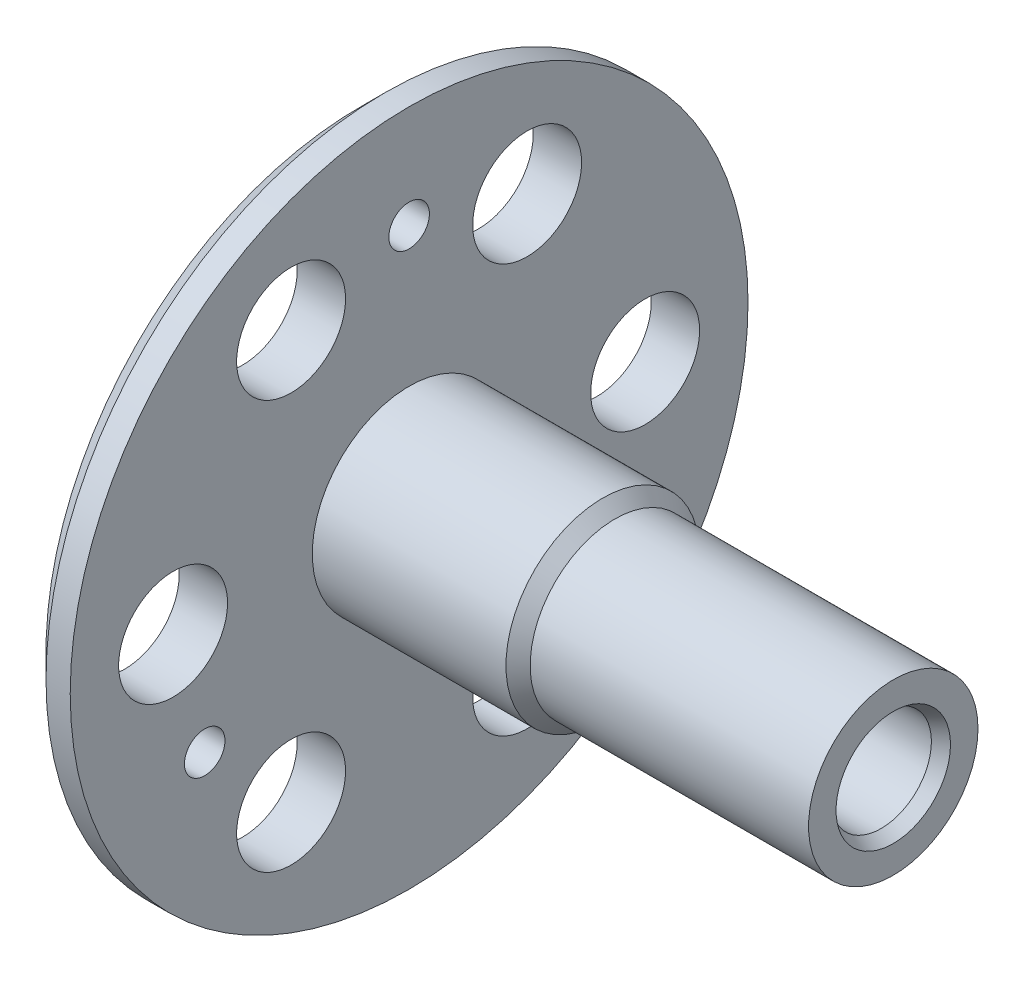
ISO-10303-21;
HEADER;
FILE_DESCRIPTION(('STEP AP214'),'2;1');
FILE_NAME('part.step','',(''),(''),'','','');
FILE_SCHEMA(('AUTOMOTIVE_DESIGN { 1 0 10303 214 1 1 1 1 }'));
ENDSEC;
DATA;
#1=APPLICATION_CONTEXT('core data for automotive mechanical design processes');
#2=APPLICATION_PROTOCOL_DEFINITION('international standard','automotive_design',2000,#1);
#3=PRODUCT_CONTEXT('',#1,'mechanical');
#4=PRODUCT('Part','Part','',(#3));
#5=PRODUCT_RELATED_PRODUCT_CATEGORY('part','',(#4));
#6=PRODUCT_DEFINITION_FORMATION('','',#4);
#7=PRODUCT_DEFINITION_CONTEXT('part definition',#1,'design');
#8=PRODUCT_DEFINITION('design','',#6,#7);
#9=PRODUCT_DEFINITION_SHAPE('','',#8);
#10=(LENGTH_UNIT() NAMED_UNIT(*) SI_UNIT(.MILLI.,.METRE.));
#11=(NAMED_UNIT(*) PLANE_ANGLE_UNIT() SI_UNIT($,.RADIAN.));
#12=(NAMED_UNIT(*) SI_UNIT($,.STERADIAN.) SOLID_ANGLE_UNIT());
#13=UNCERTAINTY_MEASURE_WITH_UNIT(LENGTH_MEASURE(1.E-05),#10,'distance_accuracy_value','');
#14=(GEOMETRIC_REPRESENTATION_CONTEXT(3) GLOBAL_UNCERTAINTY_ASSIGNED_CONTEXT((#13)) GLOBAL_UNIT_ASSIGNED_CONTEXT((#10,
#11,#12)) REPRESENTATION_CONTEXT('',''));
#15=CARTESIAN_POINT('',(0.,0.,0.));
#16=DIRECTION('',(0.,0.,1.));
#17=DIRECTION('',(1.,0.,0.));
#18=AXIS2_PLACEMENT_3D('',#15,#16,#17);
#19=CARTESIAN_POINT('',(13.,0.,0.));
#20=DIRECTION('',(-1.,0.,0.));
#21=DIRECTION('',(0.,0.,1.));
#22=AXIS2_PLACEMENT_3D('',#19,#20,#21);
#23=PLANE('',#22);
#24=CARTESIAN_POINT('',(12.9999999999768,0.,0.));
#25=DIRECTION('',(1.,0.,0.));
#26=DIRECTION('',(0.,0.,-1.));
#27=AXIS2_PLACEMENT_3D('',#24,#25,#26);
#28=CIRCLE('',#27,2.);
#29=CARTESIAN_POINT('',(12.9999999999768,0.,-2.));
#30=VERTEX_POINT('',#29);
#31=EDGE_CURVE('E107',#30,#30,#28,.F.);
#32=ORIENTED_EDGE('',*,*,#31,.T.);
#33=EDGE_LOOP('',(#32));
#34=FACE_BOUND('',#33,.T.);
#35=CARTESIAN_POINT('',(13.,0.,0.));
#36=DIRECTION('',(-1.,0.,0.));
#37=DIRECTION('',(0.,0.,1.));
#38=AXIS2_PLACEMENT_3D('',#35,#36,#37);
#39=CIRCLE('',#38,2.075);
#40=CARTESIAN_POINT('',(13.,0.,2.075));
#41=VERTEX_POINT('',#40);
#42=EDGE_CURVE('E18',#41,#41,#39,.F.);
#43=ORIENTED_EDGE('',*,*,#42,.T.);
#44=EDGE_LOOP('',(#43));
#45=FACE_BOUND('',#44,.T.);
#46=ADVANCED_FACE('F15',(#34,#45),#23,.F.);
#47=CARTESIAN_POINT('',(22.,0.,0.));
#48=DIRECTION('',(-1.,0.,0.));
#49=DIRECTION('',(0.,0.,1.));
#50=AXIS2_PLACEMENT_3D('',#47,#48,#49);
#51=CYLINDRICAL_SURFACE('',#50,2.075);
#52=ORIENTED_EDGE('',*,*,#42,.F.);
#53=EDGE_LOOP('',(#52));
#54=FACE_BOUND('',#53,.T.);
#55=CARTESIAN_POINT('',(21.4999999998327,0.,0.));
#56=DIRECTION('',(1.,0.,0.));
#57=DIRECTION('',(0.,0.,1.));
#58=AXIS2_PLACEMENT_3D('',#55,#56,#57);
#59=CIRCLE('',#58,2.0750000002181);
#60=CARTESIAN_POINT('',(21.4999999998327,0.,2.0750000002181));
#61=VERTEX_POINT('',#60);
#62=EDGE_CURVE('E106',#61,#61,#59,.T.);
#63=ORIENTED_EDGE('',*,*,#62,.T.);
#64=EDGE_LOOP('',(#63));
#65=FACE_BOUND('',#64,.T.);
#66=ADVANCED_FACE('F116',(#54,#65),#51,.F.);
#67=CARTESIAN_POINT('',(494999.999992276,0.,0.));
#68=DIRECTION('',(1.,0.,0.));
#69=DIRECTION('',(0.,0.,-1.));
#70=AXIS2_PLACEMENT_3D('',#67,#68,#69);
#71=CYLINDRICAL_SURFACE('',#70,2.);
#72=CARTESIAN_POINT('',(2.9999999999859,0.,0.));
#73=DIRECTION('',(1.,0.,0.));
#74=DIRECTION('',(0.,0.,-1.));
#75=AXIS2_PLACEMENT_3D('',#72,#73,#74);
#76=CIRCLE('',#75,2.);
#77=CARTESIAN_POINT('',(2.9999999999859,0.,-2.));
#78=VERTEX_POINT('',#77);
#79=EDGE_CURVE('E104',#78,#78,#76,.F.);
#80=ORIENTED_EDGE('',*,*,#79,.T.);
#81=EDGE_LOOP('',(#80));
#82=FACE_BOUND('',#81,.T.);
#83=ORIENTED_EDGE('',*,*,#31,.F.);
#84=EDGE_LOOP('',(#83));
#85=FACE_BOUND('',#84,.T.);
#86=ADVANCED_FACE('F119',(#82,#85),#71,.F.);
#87=CARTESIAN_POINT('',(22.0000000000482,0.,0.));
#88=DIRECTION('',(1.,0.,0.));
#89=DIRECTION('',(0.,0.,-1.));
#90=AXIS2_PLACEMENT_3D('',#87,#88,#89);
#91=CONICAL_SURFACE('',#90,2.36367513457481,0.52359877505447);
#92=CARTESIAN_POINT('',(22.0000000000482,0.,0.));
#93=DIRECTION('',(1.,0.,0.));
#94=DIRECTION('',(0.,0.,-1.));
#95=AXIS2_PLACEMENT_3D('',#92,#93,#94);
#96=CIRCLE('',#95,2.36367513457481);
#97=CARTESIAN_POINT('',(22.0000000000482,0.,-2.36367513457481));
#98=VERTEX_POINT('',#97);
#99=EDGE_CURVE('E101',#98,#98,#96,.F.);
#100=ORIENTED_EDGE('',*,*,#99,.F.);
#101=EDGE_LOOP('',(#100));
#102=FACE_BOUND('',#101,.T.);
#103=ORIENTED_EDGE('',*,*,#62,.F.);
#104=EDGE_LOOP('',(#103));
#105=FACE_BOUND('',#104,.T.);
#106=ADVANCED_FACE('F122',(#102,#105),#91,.F.);
#107=CARTESIAN_POINT('',(3.,0.,0.));
#108=DIRECTION('',(1.,0.,0.));
#109=DIRECTION('',(0.,0.,-1.));
#110=AXIS2_PLACEMENT_3D('',#107,#108,#109);
#111=PLANE('',#110);
#112=CARTESIAN_POINT('',(3.,0.,0.));
#113=DIRECTION('',(1.,0.,0.));
#114=DIRECTION('',(0.,0.,-1.));
#115=AXIS2_PLACEMENT_3D('',#112,#113,#114);
#116=CIRCLE('',#115,3.);
#117=CARTESIAN_POINT('',(3.,0.,-3.));
#118=VERTEX_POINT('',#117);
#119=EDGE_CURVE('E98',#118,#118,#116,.F.);
#120=ORIENTED_EDGE('',*,*,#119,.T.);
#121=EDGE_LOOP('',(#120));
#122=FACE_BOUND('',#121,.T.);
#123=ORIENTED_EDGE('',*,*,#79,.F.);
#124=EDGE_LOOP('',(#123));
#125=FACE_BOUND('',#124,.T.);
#126=ADVANCED_FACE('F124',(#122,#125),#111,.F.);
#127=CARTESIAN_POINT('',(22.,0.,0.));
#128=DIRECTION('',(1.,0.,0.));
#129=DIRECTION('',(0.,0.,-1.));
#130=AXIS2_PLACEMENT_3D('',#127,#128,#129);
#131=PLANE('',#130);
#132=CARTESIAN_POINT('',(22.,0.,0.));
#133=DIRECTION('',(1.,0.,0.));
#134=DIRECTION('',(0.,0.,-1.));
#135=AXIS2_PLACEMENT_3D('',#132,#133,#134);
#136=CIRCLE('',#135,3.5);
#137=CARTESIAN_POINT('',(22.,0.,-3.5));
#138=VERTEX_POINT('',#137);
#139=EDGE_CURVE('E95',#138,#138,#136,.F.);
#140=ORIENTED_EDGE('',*,*,#139,.F.);
#141=EDGE_LOOP('',(#140));
#142=FACE_BOUND('',#141,.T.);
#143=ORIENTED_EDGE('',*,*,#99,.T.);
#144=EDGE_LOOP('',(#143));
#145=FACE_BOUND('',#144,.T.);
#146=ADVANCED_FACE('F132',(#142,#145),#131,.T.);
#147=CARTESIAN_POINT('',(0.,0.,0.));
#148=DIRECTION('',(1.,0.,0.));
#149=DIRECTION('',(0.,0.,-1.));
#150=AXIS2_PLACEMENT_3D('',#147,#148,#149);
#151=CYLINDRICAL_SURFACE('',#150,3.);
#152=CARTESIAN_POINT('',(0.,0.,0.));
#153=DIRECTION('',(1.,0.,0.));
#154=DIRECTION('',(0.,0.,-1.));
#155=AXIS2_PLACEMENT_3D('',#152,#153,#154);
#156=CIRCLE('',#155,3.);
#157=CARTESIAN_POINT('',(0.,0.,-3.));
#158=VERTEX_POINT('',#157);
#159=EDGE_CURVE('E92',#158,#158,#156,.T.);
#160=ORIENTED_EDGE('',*,*,#159,.F.);
#161=EDGE_LOOP('',(#160));
#162=FACE_BOUND('',#161,.T.);
#163=ORIENTED_EDGE('',*,*,#119,.F.);
#164=EDGE_LOOP('',(#163));
#165=FACE_BOUND('',#164,.T.);
#166=ADVANCED_FACE('F204',(#162,#165),#151,.F.);
#167=CARTESIAN_POINT('',(10.5,0.,0.));
#168=DIRECTION('',(1.,0.,0.));
#169=DIRECTION('',(0.,0.,-1.));
#170=AXIS2_PLACEMENT_3D('',#167,#168,#169);
#171=CYLINDRICAL_SURFACE('',#170,3.5);
#172=CARTESIAN_POINT('',(10.4999999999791,0.,0.));
#173=DIRECTION('',(-1.,0.,0.));
#174=DIRECTION('',(0.,0.,-1.));
#175=AXIS2_PLACEMENT_3D('',#172,#173,#174);
#176=CIRCLE('',#175,3.49999999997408);
#177=CARTESIAN_POINT('',(10.4999999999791,0.,-3.49999999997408));
#178=VERTEX_POINT('',#177);
#179=EDGE_CURVE('E91',#178,#178,#176,.T.);
#180=ORIENTED_EDGE('',*,*,#179,.F.);
#181=EDGE_LOOP('',(#180));
#182=FACE_BOUND('',#181,.T.);
#183=ORIENTED_EDGE('',*,*,#139,.T.);
#184=EDGE_LOOP('',(#183));
#185=FACE_BOUND('',#184,.T.);
#186=ADVANCED_FACE('F200',(#182,#185),#171,.T.);
#187=CARTESIAN_POINT('',(0.,0.,0.));
#188=DIRECTION('',(-1.,0.,0.));
#189=DIRECTION('',(0.,0.,1.));
#190=AXIS2_PLACEMENT_3D('',#187,#188,#189);
#191=PLANE('',#190);
#192=ORIENTED_EDGE('',*,*,#159,.T.);
#193=EDGE_LOOP('',(#192));
#194=FACE_BOUND('',#193,.T.);
#195=CARTESIAN_POINT('',(0.,-8.44374768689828,-4.875));
#196=DIRECTION('',(1.,0.,0.));
#197=DIRECTION('',(0.,0.,-1.));
#198=AXIS2_PLACEMENT_3D('',#195,#196,#197);
#199=CIRCLE('',#198,2.25);
#200=CARTESIAN_POINT('',(0.,-8.44374768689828,-7.125));
#201=VERTEX_POINT('',#200);
#202=EDGE_CURVE('E60',#201,#201,#199,.T.);
#203=ORIENTED_EDGE('',*,*,#202,.T.);
#204=EDGE_LOOP('',(#203));
#205=FACE_BOUND('',#204,.T.);
#206=CARTESIAN_POINT('',(0.,-4.875,-8.44374768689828));
#207=DIRECTION('',(1.,0.,0.));
#208=DIRECTION('',(0.,0.,-1.));
#209=AXIS2_PLACEMENT_3D('',#206,#207,#208);
#210=CIRCLE('',#209,0.8376);
#211=CARTESIAN_POINT('',(0.,-4.875,-9.28134768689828));
#212=VERTEX_POINT('',#211);
#213=EDGE_CURVE('E64',#212,#212,#210,.T.);
#214=ORIENTED_EDGE('',*,*,#213,.T.);
#215=EDGE_LOOP('',(#214));
#216=FACE_BOUND('',#215,.T.);
#217=CARTESIAN_POINT('',(0.,0.,-9.75));
#218=DIRECTION('',(1.,0.,0.));
#219=DIRECTION('',(0.,0.,-1.));
#220=AXIS2_PLACEMENT_3D('',#217,#218,#219);
#221=CIRCLE('',#220,2.25);
#222=CARTESIAN_POINT('',(0.,0.,-12.));
#223=VERTEX_POINT('',#222);
#224=EDGE_CURVE('E67',#223,#223,#221,.T.);
#225=ORIENTED_EDGE('',*,*,#224,.T.);
#226=EDGE_LOOP('',(#225));
#227=FACE_BOUND('',#226,.T.);
#228=CARTESIAN_POINT('',(0.,8.44374768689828,-4.87500000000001));
#229=DIRECTION('',(1.,0.,0.));
#230=DIRECTION('',(0.,0.,-1.));
#231=AXIS2_PLACEMENT_3D('',#228,#229,#230);
#232=CIRCLE('',#231,2.25);
#233=CARTESIAN_POINT('',(0.,8.44374768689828,-7.12500000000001));
#234=VERTEX_POINT('',#233);
#235=EDGE_CURVE('E70',#234,#234,#232,.T.);
#236=ORIENTED_EDGE('',*,*,#235,.T.);
#237=EDGE_LOOP('',(#236));
#238=FACE_BOUND('',#237,.T.);
#239=CARTESIAN_POINT('',(0.,8.44374768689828,4.87499999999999));
#240=DIRECTION('',(1.,0.,0.));
#241=DIRECTION('',(0.,0.,-1.));
#242=AXIS2_PLACEMENT_3D('',#239,#240,#241);
#243=CIRCLE('',#242,2.25);
#244=CARTESIAN_POINT('',(0.,8.44374768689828,2.62499999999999));
#245=VERTEX_POINT('',#244);
#246=EDGE_CURVE('E73',#245,#245,#243,.T.);
#247=ORIENTED_EDGE('',*,*,#246,.T.);
#248=EDGE_LOOP('',(#247));
#249=FACE_BOUND('',#248,.T.);
#250=CARTESIAN_POINT('',(0.,0.,9.75));
#251=DIRECTION('',(1.,0.,0.));
#252=DIRECTION('',(0.,0.,-1.));
#253=AXIS2_PLACEMENT_3D('',#250,#251,#252);
#254=CIRCLE('',#253,2.25);
#255=CARTESIAN_POINT('',(0.,0.,7.5));
#256=VERTEX_POINT('',#255);
#257=EDGE_CURVE('E76',#256,#256,#254,.T.);
#258=ORIENTED_EDGE('',*,*,#257,.T.);
#259=EDGE_LOOP('',(#258));
#260=FACE_BOUND('',#259,.T.);
#261=CARTESIAN_POINT('',(0.,-8.44374768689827,4.87500000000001));
#262=DIRECTION('',(1.,0.,0.));
#263=DIRECTION('',(0.,0.,-1.));
#264=AXIS2_PLACEMENT_3D('',#261,#262,#263);
#265=CIRCLE('',#264,2.25);
#266=CARTESIAN_POINT('',(0.,-8.44374768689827,2.62500000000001));
#267=VERTEX_POINT('',#266);
#268=EDGE_CURVE('E79',#267,#267,#265,.T.);
#269=ORIENTED_EDGE('',*,*,#268,.T.);
#270=EDGE_LOOP('',(#269));
#271=FACE_BOUND('',#270,.T.);
#272=CARTESIAN_POINT('',(0.,9.75,0.));
#273=DIRECTION('',(1.,0.,0.));
#274=DIRECTION('',(0.,0.,-1.));
#275=AXIS2_PLACEMENT_3D('',#272,#273,#274);
#276=CIRCLE('',#275,0.8376);
#277=CARTESIAN_POINT('',(0.,9.75,-0.837599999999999));
#278=VERTEX_POINT('',#277);
#279=EDGE_CURVE('E82',#278,#278,#276,.T.);
#280=ORIENTED_EDGE('',*,*,#279,.T.);
#281=EDGE_LOOP('',(#280));
#282=FACE_BOUND('',#281,.T.);
#283=CARTESIAN_POINT('',(0.,-4.875,8.44374768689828));
#284=DIRECTION('',(1.,0.,0.));
#285=DIRECTION('',(0.,0.,-1.));
#286=AXIS2_PLACEMENT_3D('',#283,#284,#285);
#287=CIRCLE('',#286,0.8376);
#288=CARTESIAN_POINT('',(0.,-4.875,7.60614768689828));
#289=VERTEX_POINT('',#288);
#290=EDGE_CURVE('E85',#289,#289,#287,.T.);
#291=ORIENTED_EDGE('',*,*,#290,.T.);
#292=EDGE_LOOP('',(#291));
#293=FACE_BOUND('',#292,.T.);
#294=CARTESIAN_POINT('',(-8.97447697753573E-10,0.,0.));
#295=DIRECTION('',(1.,0.,0.));
#296=DIRECTION('',(0.,0.,-1.));
#297=AXIS2_PLACEMENT_3D('',#294,#295,#296);
#298=CIRCLE('',#297,13.0000000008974);
#299=CARTESIAN_POINT('',(-8.97447697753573E-10,0.,-13.0000000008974));
#300=VERTEX_POINT('',#299);
#301=EDGE_CURVE('E88',#300,#300,#298,.T.);
#302=ORIENTED_EDGE('',*,*,#301,.F.);
#303=EDGE_LOOP('',(#302));
#304=FACE_BOUND('',#303,.T.);
#305=ADVANCED_FACE('F196',(#194,#205,#216,#227,#238,#249,#260,#271,#282,#293,#304),#191,.T.);
#306=CARTESIAN_POINT('',(9.999999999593,0.,0.));
#307=DIRECTION('',(-1.,0.,0.));
#308=DIRECTION('',(0.,0.,1.));
#309=AXIS2_PLACEMENT_3D('',#306,#307,#308);
#310=CONICAL_SURFACE('',#309,3.99999999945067,0.785398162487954);
#311=ORIENTED_EDGE('',*,*,#179,.T.);
#312=EDGE_LOOP('',(#311));
#313=FACE_BOUND('',#312,.T.);
#314=CARTESIAN_POINT('',(10.,0.,0.));
#315=DIRECTION('',(1.,0.,0.));
#316=DIRECTION('',(0.,0.,-1.));
#317=AXIS2_PLACEMENT_3D('',#314,#315,#316);
#318=CIRCLE('',#317,4.);
#319=CARTESIAN_POINT('',(10.,0.,-4.));
#320=VERTEX_POINT('',#319);
#321=EDGE_CURVE('E63',#320,#320,#318,.F.);
#322=ORIENTED_EDGE('',*,*,#321,.F.);
#323=EDGE_LOOP('',(#322));
#324=FACE_BOUND('',#323,.T.);
#325=ADVANCED_FACE('F192',(#313,#324),#310,.T.);
#326=CARTESIAN_POINT('',(1.,0.,0.));
#327=DIRECTION('',(1.,0.,0.));
#328=DIRECTION('',(0.,0.,-1.));
#329=AXIS2_PLACEMENT_3D('',#326,#327,#328);
#330=CONICAL_SURFACE('',#329,14.,0.7853981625);
#331=CARTESIAN_POINT('',(1.,0.,0.));
#332=DIRECTION('',(1.,0.,0.));
#333=DIRECTION('',(0.,0.,-1.));
#334=AXIS2_PLACEMENT_3D('',#331,#332,#333);
#335=CIRCLE('',#334,14.);
#336=CARTESIAN_POINT('',(1.,0.,-14.));
#337=VERTEX_POINT('',#336);
#338=EDGE_CURVE('E59',#337,#337,#335,.T.);
#339=ORIENTED_EDGE('',*,*,#338,.F.);
#340=EDGE_LOOP('',(#339));
#341=FACE_BOUND('',#340,.T.);
#342=ORIENTED_EDGE('',*,*,#301,.T.);
#343=EDGE_LOOP('',(#342));
#344=FACE_BOUND('',#343,.T.);
#345=ADVANCED_FACE('F188',(#341,#344),#330,.T.);
#346=CARTESIAN_POINT('',(0.,-4.875,8.44374768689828));
#347=DIRECTION('',(1.,0.,0.));
#348=DIRECTION('',(0.,0.,-1.));
#349=AXIS2_PLACEMENT_3D('',#346,#347,#348);
#350=CYLINDRICAL_SURFACE('',#349,0.8376);
#351=ORIENTED_EDGE('',*,*,#290,.F.);
#352=EDGE_LOOP('',(#351));
#353=FACE_BOUND('',#352,.T.);
#354=CARTESIAN_POINT('',(2.,-4.875,8.44374768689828));
#355=DIRECTION('',(1.,0.,0.));
#356=DIRECTION('',(0.,0.,-1.));
#357=AXIS2_PLACEMENT_3D('',#354,#355,#356);
#358=CIRCLE('',#357,0.8376);
#359=CARTESIAN_POINT('',(2.,-4.875,7.60614768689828));
#360=VERTEX_POINT('',#359);
#361=EDGE_CURVE('E56',#360,#360,#358,.F.);
#362=ORIENTED_EDGE('',*,*,#361,.F.);
#363=EDGE_LOOP('',(#362));
#364=FACE_BOUND('',#363,.T.);
#365=ADVANCED_FACE('F184',(#353,#364),#350,.F.);
#366=CARTESIAN_POINT('',(0.,9.75,0.));
#367=DIRECTION('',(1.,0.,0.));
#368=DIRECTION('',(0.,0.,-1.));
#369=AXIS2_PLACEMENT_3D('',#366,#367,#368);
#370=CYLINDRICAL_SURFACE('',#369,0.8376);
#371=ORIENTED_EDGE('',*,*,#279,.F.);
#372=EDGE_LOOP('',(#371));
#373=FACE_BOUND('',#372,.T.);
#374=CARTESIAN_POINT('',(2.,9.75,0.));
#375=DIRECTION('',(1.,0.,0.));
#376=DIRECTION('',(0.,0.,-1.));
#377=AXIS2_PLACEMENT_3D('',#374,#375,#376);
#378=CIRCLE('',#377,0.8376);
#379=CARTESIAN_POINT('',(2.,9.75,-0.837599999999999));
#380=VERTEX_POINT('',#379);
#381=EDGE_CURVE('E53',#380,#380,#378,.F.);
#382=ORIENTED_EDGE('',*,*,#381,.F.);
#383=EDGE_LOOP('',(#382));
#384=FACE_BOUND('',#383,.T.);
#385=ADVANCED_FACE('F180',(#373,#384),#370,.F.);
#386=CARTESIAN_POINT('',(0.,-8.44374768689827,4.87500000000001));
#387=DIRECTION('',(1.,0.,0.));
#388=DIRECTION('',(0.,0.,-1.));
#389=AXIS2_PLACEMENT_3D('',#386,#387,#388);
#390=CYLINDRICAL_SURFACE('',#389,2.25);
#391=ORIENTED_EDGE('',*,*,#268,.F.);
#392=EDGE_LOOP('',(#391));
#393=FACE_BOUND('',#392,.T.);
#394=CARTESIAN_POINT('',(2.,-8.44374768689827,4.87500000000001));
#395=DIRECTION('',(1.,0.,0.));
#396=DIRECTION('',(0.,0.,-1.));
#397=AXIS2_PLACEMENT_3D('',#394,#395,#396);
#398=CIRCLE('',#397,2.25);
#399=CARTESIAN_POINT('',(2.,-8.44374768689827,2.62500000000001));
#400=VERTEX_POINT('',#399);
#401=EDGE_CURVE('E50',#400,#400,#398,.F.);
#402=ORIENTED_EDGE('',*,*,#401,.F.);
#403=EDGE_LOOP('',(#402));
#404=FACE_BOUND('',#403,.T.);
#405=ADVANCED_FACE('F176',(#393,#404),#390,.F.);
#406=CARTESIAN_POINT('',(0.,0.,9.75));
#407=DIRECTION('',(1.,0.,0.));
#408=DIRECTION('',(0.,0.,-1.));
#409=AXIS2_PLACEMENT_3D('',#406,#407,#408);
#410=CYLINDRICAL_SURFACE('',#409,2.25);
#411=ORIENTED_EDGE('',*,*,#257,.F.);
#412=EDGE_LOOP('',(#411));
#413=FACE_BOUND('',#412,.T.);
#414=CARTESIAN_POINT('',(2.,0.,9.75));
#415=DIRECTION('',(1.,0.,0.));
#416=DIRECTION('',(0.,0.,-1.));
#417=AXIS2_PLACEMENT_3D('',#414,#415,#416);
#418=CIRCLE('',#417,2.25);
#419=CARTESIAN_POINT('',(2.,0.,7.5));
#420=VERTEX_POINT('',#419);
#421=EDGE_CURVE('E47',#420,#420,#418,.F.);
#422=ORIENTED_EDGE('',*,*,#421,.F.);
#423=EDGE_LOOP('',(#422));
#424=FACE_BOUND('',#423,.T.);
#425=ADVANCED_FACE('F172',(#413,#424),#410,.F.);
#426=CARTESIAN_POINT('',(0.,8.44374768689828,4.87499999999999));
#427=DIRECTION('',(1.,0.,0.));
#428=DIRECTION('',(0.,0.,-1.));
#429=AXIS2_PLACEMENT_3D('',#426,#427,#428);
#430=CYLINDRICAL_SURFACE('',#429,2.25);
#431=ORIENTED_EDGE('',*,*,#246,.F.);
#432=EDGE_LOOP('',(#431));
#433=FACE_BOUND('',#432,.T.);
#434=CARTESIAN_POINT('',(2.,8.44374768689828,4.87499999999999));
#435=DIRECTION('',(1.,0.,0.));
#436=DIRECTION('',(0.,0.,-1.));
#437=AXIS2_PLACEMENT_3D('',#434,#435,#436);
#438=CIRCLE('',#437,2.25);
#439=CARTESIAN_POINT('',(2.,8.44374768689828,2.62499999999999));
#440=VERTEX_POINT('',#439);
#441=EDGE_CURVE('E44',#440,#440,#438,.F.);
#442=ORIENTED_EDGE('',*,*,#441,.F.);
#443=EDGE_LOOP('',(#442));
#444=FACE_BOUND('',#443,.T.);
#445=ADVANCED_FACE('F168',(#433,#444),#430,.F.);
#446=CARTESIAN_POINT('',(0.,8.44374768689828,-4.87500000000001));
#447=DIRECTION('',(1.,0.,0.));
#448=DIRECTION('',(0.,0.,-1.));
#449=AXIS2_PLACEMENT_3D('',#446,#447,#448);
#450=CYLINDRICAL_SURFACE('',#449,2.25);
#451=ORIENTED_EDGE('',*,*,#235,.F.);
#452=EDGE_LOOP('',(#451));
#453=FACE_BOUND('',#452,.T.);
#454=CARTESIAN_POINT('',(2.,8.44374768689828,-4.87500000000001));
#455=DIRECTION('',(1.,0.,0.));
#456=DIRECTION('',(0.,0.,-1.));
#457=AXIS2_PLACEMENT_3D('',#454,#455,#456);
#458=CIRCLE('',#457,2.25);
#459=CARTESIAN_POINT('',(2.,8.44374768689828,-7.12500000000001));
#460=VERTEX_POINT('',#459);
#461=EDGE_CURVE('E41',#460,#460,#458,.F.);
#462=ORIENTED_EDGE('',*,*,#461,.F.);
#463=EDGE_LOOP('',(#462));
#464=FACE_BOUND('',#463,.T.);
#465=ADVANCED_FACE('F164',(#453,#464),#450,.F.);
#466=CARTESIAN_POINT('',(0.,0.,-9.75));
#467=DIRECTION('',(1.,0.,0.));
#468=DIRECTION('',(0.,0.,-1.));
#469=AXIS2_PLACEMENT_3D('',#466,#467,#468);
#470=CYLINDRICAL_SURFACE('',#469,2.25);
#471=ORIENTED_EDGE('',*,*,#224,.F.);
#472=EDGE_LOOP('',(#471));
#473=FACE_BOUND('',#472,.T.);
#474=CARTESIAN_POINT('',(2.,0.,-9.75));
#475=DIRECTION('',(1.,0.,0.));
#476=DIRECTION('',(0.,0.,-1.));
#477=AXIS2_PLACEMENT_3D('',#474,#475,#476);
#478=CIRCLE('',#477,2.25);
#479=CARTESIAN_POINT('',(2.,0.,-12.));
#480=VERTEX_POINT('',#479);
#481=EDGE_CURVE('E38',#480,#480,#478,.F.);
#482=ORIENTED_EDGE('',*,*,#481,.F.);
#483=EDGE_LOOP('',(#482));
#484=FACE_BOUND('',#483,.T.);
#485=ADVANCED_FACE('F160',(#473,#484),#470,.F.);
#486=CARTESIAN_POINT('',(0.,-4.875,-8.44374768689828));
#487=DIRECTION('',(1.,0.,0.));
#488=DIRECTION('',(0.,0.,-1.));
#489=AXIS2_PLACEMENT_3D('',#486,#487,#488);
#490=CYLINDRICAL_SURFACE('',#489,0.8376);
#491=ORIENTED_EDGE('',*,*,#213,.F.);
#492=EDGE_LOOP('',(#491));
#493=FACE_BOUND('',#492,.T.);
#494=CARTESIAN_POINT('',(2.,-4.875,-8.44374768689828));
#495=DIRECTION('',(1.,0.,0.));
#496=DIRECTION('',(0.,0.,-1.));
#497=AXIS2_PLACEMENT_3D('',#494,#495,#496);
#498=CIRCLE('',#497,0.8376);
#499=CARTESIAN_POINT('',(2.,-4.875,-9.28134768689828));
#500=VERTEX_POINT('',#499);
#501=EDGE_CURVE('E35',#500,#500,#498,.F.);
#502=ORIENTED_EDGE('',*,*,#501,.F.);
#503=EDGE_LOOP('',(#502));
#504=FACE_BOUND('',#503,.T.);
#505=ADVANCED_FACE('F156',(#493,#504),#490,.F.);
#506=CARTESIAN_POINT('',(0.,-8.44374768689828,-4.875));
#507=DIRECTION('',(1.,0.,0.));
#508=DIRECTION('',(0.,0.,-1.));
#509=AXIS2_PLACEMENT_3D('',#506,#507,#508);
#510=CYLINDRICAL_SURFACE('',#509,2.25);
#511=ORIENTED_EDGE('',*,*,#202,.F.);
#512=EDGE_LOOP('',(#511));
#513=FACE_BOUND('',#512,.T.);
#514=CARTESIAN_POINT('',(2.,-8.44374768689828,-4.875));
#515=DIRECTION('',(1.,0.,0.));
#516=DIRECTION('',(0.,0.,-1.));
#517=AXIS2_PLACEMENT_3D('',#514,#515,#516);
#518=CIRCLE('',#517,2.25);
#519=CARTESIAN_POINT('',(2.,-8.44374768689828,-7.125));
#520=VERTEX_POINT('',#519);
#521=EDGE_CURVE('E27',#520,#520,#518,.F.);
#522=ORIENTED_EDGE('',*,*,#521,.F.);
#523=EDGE_LOOP('',(#522));
#524=FACE_BOUND('',#523,.T.);
#525=ADVANCED_FACE('F152',(#513,#524),#510,.F.);
#526=CARTESIAN_POINT('',(2.,0.,0.));
#527=DIRECTION('',(1.,0.,0.));
#528=DIRECTION('',(0.,0.,-1.));
#529=AXIS2_PLACEMENT_3D('',#526,#527,#528);
#530=CYLINDRICAL_SURFACE('',#529,4.);
#531=CARTESIAN_POINT('',(2.,0.,0.));
#532=DIRECTION('',(1.,0.,0.));
#533=DIRECTION('',(0.,0.,-1.));
#534=AXIS2_PLACEMENT_3D('',#531,#532,#533);
#535=CIRCLE('',#534,4.);
#536=CARTESIAN_POINT('',(2.,0.,-4.));
#537=VERTEX_POINT('',#536);
#538=EDGE_CURVE('E22',#537,#537,#535,.F.);
#539=ORIENTED_EDGE('',*,*,#538,.F.);
#540=EDGE_LOOP('',(#539));
#541=FACE_BOUND('',#540,.T.);
#542=ORIENTED_EDGE('',*,*,#321,.T.);
#543=EDGE_LOOP('',(#542));
#544=FACE_BOUND('',#543,.T.);
#545=ADVANCED_FACE('F145',(#541,#544),#530,.T.);
#546=CARTESIAN_POINT('',(0.,0.,0.));
#547=DIRECTION('',(1.,0.,0.));
#548=DIRECTION('',(0.,0.,-1.));
#549=AXIS2_PLACEMENT_3D('',#546,#547,#548);
#550=CYLINDRICAL_SURFACE('',#549,14.);
#551=CARTESIAN_POINT('',(2.,0.,0.));
#552=DIRECTION('',(1.,0.,0.));
#553=DIRECTION('',(0.,0.,-1.));
#554=AXIS2_PLACEMENT_3D('',#551,#552,#553);
#555=CIRCLE('',#554,14.);
#556=CARTESIAN_POINT('',(2.,0.,-14.));
#557=VERTEX_POINT('',#556);
#558=EDGE_CURVE('E10',#557,#557,#555,.T.);
#559=ORIENTED_EDGE('',*,*,#558,.F.);
#560=EDGE_LOOP('',(#559));
#561=FACE_BOUND('',#560,.T.);
#562=ORIENTED_EDGE('',*,*,#338,.T.);
#563=EDGE_LOOP('',(#562));
#564=FACE_BOUND('',#563,.T.);
#565=ADVANCED_FACE('F140',(#561,#564),#550,.T.);
#566=CARTESIAN_POINT('',(2.,0.,0.));
#567=DIRECTION('',(1.,0.,0.));
#568=DIRECTION('',(0.,0.,-1.));
#569=AXIS2_PLACEMENT_3D('',#566,#567,#568);
#570=PLANE('',#569);
#571=ORIENTED_EDGE('',*,*,#558,.T.);
#572=EDGE_LOOP('',(#571));
#573=FACE_BOUND('',#572,.T.);
#574=ORIENTED_EDGE('',*,*,#538,.T.);
#575=EDGE_LOOP('',(#574));
#576=FACE_BOUND('',#575,.T.);
#577=ORIENTED_EDGE('',*,*,#521,.T.);
#578=EDGE_LOOP('',(#577));
#579=FACE_BOUND('',#578,.T.);
#580=ORIENTED_EDGE('',*,*,#501,.T.);
#581=EDGE_LOOP('',(#580));
#582=FACE_BOUND('',#581,.T.);
#583=ORIENTED_EDGE('',*,*,#481,.T.);
#584=EDGE_LOOP('',(#583));
#585=FACE_BOUND('',#584,.T.);
#586=ORIENTED_EDGE('',*,*,#461,.T.);
#587=EDGE_LOOP('',(#586));
#588=FACE_BOUND('',#587,.T.);
#589=ORIENTED_EDGE('',*,*,#441,.T.);
#590=EDGE_LOOP('',(#589));
#591=FACE_BOUND('',#590,.T.);
#592=ORIENTED_EDGE('',*,*,#421,.T.);
#593=EDGE_LOOP('',(#592));
#594=FACE_BOUND('',#593,.T.);
#595=ORIENTED_EDGE('',*,*,#401,.T.);
#596=EDGE_LOOP('',(#595));
#597=FACE_BOUND('',#596,.T.);
#598=ORIENTED_EDGE('',*,*,#381,.T.);
#599=EDGE_LOOP('',(#598));
#600=FACE_BOUND('',#599,.T.);
#601=ORIENTED_EDGE('',*,*,#361,.T.);
#602=EDGE_LOOP('',(#601));
#603=FACE_BOUND('',#602,.T.);
#604=ADVANCED_FACE('F138',(#573,#576,#579,#582,#585,#588,#591,#594,#597,#600,#603),#570,.T.);
#605=CLOSED_SHELL('',(#46,#66,#86,#106,#126,#146,#166,#186,#305,#325,#345,#365,#385,#405,#425,
#445,#465,#485,#505,#525,#545,#565,#604));
#606=MANIFOLD_SOLID_BREP('B1',#605);
#607=ADVANCED_BREP_SHAPE_REPRESENTATION('',(#18,#606),#14);
#608=SHAPE_DEFINITION_REPRESENTATION(#9,#607);
ENDSEC;
END-ISO-10303-21;
